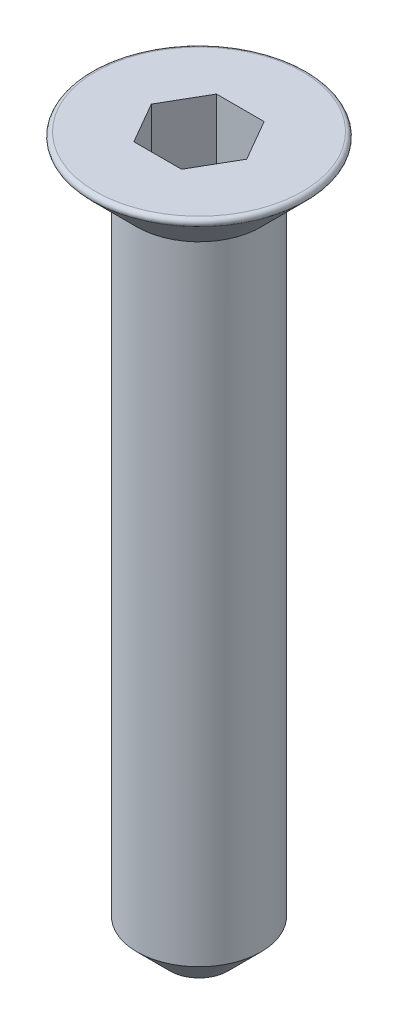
ISO-10303-21;
HEADER;
FILE_DESCRIPTION(('STEP AP214'),'2;1');
FILE_NAME('part.step','',(''),(''),'','','');
FILE_SCHEMA(('AUTOMOTIVE_DESIGN { 1 0 10303 214 1 1 1 1 }'));
ENDSEC;
DATA;
#1=APPLICATION_CONTEXT('core data for automotive mechanical design processes');
#2=APPLICATION_PROTOCOL_DEFINITION('international standard','automotive_design',2000,#1);
#3=PRODUCT_CONTEXT('',#1,'mechanical');
#4=PRODUCT('Part','Part','',(#3));
#5=PRODUCT_RELATED_PRODUCT_CATEGORY('part','',(#4));
#6=PRODUCT_DEFINITION_FORMATION('','',#4);
#7=PRODUCT_DEFINITION_CONTEXT('part definition',#1,'design');
#8=PRODUCT_DEFINITION('design','',#6,#7);
#9=PRODUCT_DEFINITION_SHAPE('','',#8);
#10=(LENGTH_UNIT() NAMED_UNIT(*) SI_UNIT(.MILLI.,.METRE.));
#11=(NAMED_UNIT(*) PLANE_ANGLE_UNIT() SI_UNIT($,.RADIAN.));
#12=(NAMED_UNIT(*) SI_UNIT($,.STERADIAN.) SOLID_ANGLE_UNIT());
#13=UNCERTAINTY_MEASURE_WITH_UNIT(LENGTH_MEASURE(1.E-05),#10,'distance_accuracy_value','');
#14=(GEOMETRIC_REPRESENTATION_CONTEXT(3) GLOBAL_UNCERTAINTY_ASSIGNED_CONTEXT((#13)) GLOBAL_UNIT_ASSIGNED_CONTEXT((#10,
#11,#12)) REPRESENTATION_CONTEXT('',''));
#15=CARTESIAN_POINT('',(0.,0.,0.));
#16=DIRECTION('',(0.,0.,1.));
#17=DIRECTION('',(1.,0.,0.));
#18=AXIS2_PLACEMENT_3D('',#15,#16,#17);
#19=CARTESIAN_POINT('',(0.,0.,0.));
#20=DIRECTION('',(0.,1.,0.));
#21=DIRECTION('',(0.,0.,1.));
#22=AXIS2_PLACEMENT_3D('',#19,#20,#21);
#23=PLANE('',#22);
#24=DIRECTION('',(0.5,0.,-0.866025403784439));
#25=VECTOR('',#24,1.);
#26=CARTESIAN_POINT('',(0.577350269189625,0.,1.));
#27=LINE('',#26,#25);
#28=CARTESIAN_POINT('',(0.577350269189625,0.,1.));
#29=VERTEX_POINT('',#28);
#30=CARTESIAN_POINT('',(1.15470053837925,0.,0.));
#31=VERTEX_POINT('',#30);
#32=EDGE_CURVE('E48',#29,#31,#27,.T.);
#33=ORIENTED_EDGE('',*,*,#32,.F.);
#34=DIRECTION('',(1.,0.,0.));
#35=VECTOR('',#34,1.);
#36=CARTESIAN_POINT('',(-0.577350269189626,0.,1.));
#37=LINE('',#36,#35);
#38=CARTESIAN_POINT('',(-0.577350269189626,0.,1.));
#39=VERTEX_POINT('',#38);
#40=EDGE_CURVE('E131',#39,#29,#37,.T.);
#41=ORIENTED_EDGE('',*,*,#40,.F.);
#42=DIRECTION('',(0.5,0.,0.866025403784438));
#43=VECTOR('',#42,1.);
#44=CARTESIAN_POINT('',(-1.15470053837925,0.,0.));
#45=LINE('',#44,#43);
#46=CARTESIAN_POINT('',(-1.15470053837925,0.,0.));
#47=VERTEX_POINT('',#46);
#48=EDGE_CURVE('E129',#47,#39,#45,.T.);
#49=ORIENTED_EDGE('',*,*,#48,.F.);
#50=DIRECTION('',(-0.5,0.,0.866025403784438));
#51=VECTOR('',#50,1.);
#52=CARTESIAN_POINT('',(-0.577350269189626,0.,-1.));
#53=LINE('',#52,#51);
#54=CARTESIAN_POINT('',(-0.577350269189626,0.,-1.));
#55=VERTEX_POINT('',#54);
#56=EDGE_CURVE('E96',#55,#47,#53,.T.);
#57=ORIENTED_EDGE('',*,*,#56,.F.);
#58=DIRECTION('',(-1.,0.,0.));
#59=VECTOR('',#58,1.);
#60=CARTESIAN_POINT('',(0.577350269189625,0.,-1.));
#61=LINE('',#60,#59);
#62=CARTESIAN_POINT('',(0.577350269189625,0.,-1.));
#63=VERTEX_POINT('',#62);
#64=EDGE_CURVE('E125',#63,#55,#61,.T.);
#65=ORIENTED_EDGE('',*,*,#64,.F.);
#66=DIRECTION('',(-0.5,0.,-0.866025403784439));
#67=VECTOR('',#66,1.);
#68=CARTESIAN_POINT('',(1.15470053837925,0.,0.));
#69=LINE('',#68,#67);
#70=EDGE_CURVE('E122',#31,#63,#69,.T.);
#71=ORIENTED_EDGE('',*,*,#70,.F.);
#72=EDGE_LOOP('',(#33,#41,#49,#57,#65,#71));
#73=FACE_BOUND('',#72,.T.);
#74=CARTESIAN_POINT('',(0.,0.,0.));
#75=DIRECTION('',(0.,1.,0.));
#76=DIRECTION('',(0.,0.,1.));
#77=AXIS2_PLACEMENT_3D('',#74,#75,#76);
#78=CIRCLE('',#77,2.50857864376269);
#79=CARTESIAN_POINT('',(0.,0.,2.50857864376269));
#80=VERTEX_POINT('',#79);
#81=EDGE_CURVE('E143',#80,#80,#78,.T.);
#82=ORIENTED_EDGE('',*,*,#81,.T.);
#83=EDGE_LOOP('',(#82));
#84=FACE_BOUND('',#83,.T.);
#85=ADVANCED_FACE('F33',(#73,#84),#23,.T.);
#86=CARTESIAN_POINT('',(0.,0.,0.));
#87=DIRECTION('',(0.,1.,0.));
#88=DIRECTION('',(0.,0.,1.));
#89=AXIS2_PLACEMENT_3D('',#86,#87,#88);
#90=CONICAL_SURFACE('',#89,2.75,0.78539816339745);
#91=CARTESIAN_POINT('',(0.,-0.170710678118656,0.));
#92=DIRECTION('',(0.,-1.,0.));
#93=DIRECTION('',(0.,0.,-1.));
#94=AXIS2_PLACEMENT_3D('',#91,#92,#93);
#95=CIRCLE('',#94,2.57928932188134);
#96=CARTESIAN_POINT('',(0.,-0.170710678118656,-2.57928932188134));
#97=VERTEX_POINT('',#96);
#98=EDGE_CURVE('E146',#97,#97,#95,.T.);
#99=ORIENTED_EDGE('',*,*,#98,.T.);
#100=EDGE_LOOP('',(#99));
#101=FACE_BOUND('',#100,.T.);
#102=CARTESIAN_POINT('',(0.,-1.25,0.));
#103=DIRECTION('',(0.,1.,0.));
#104=DIRECTION('',(0.,0.,1.));
#105=AXIS2_PLACEMENT_3D('',#102,#103,#104);
#106=CIRCLE('',#105,1.5);
#107=CARTESIAN_POINT('',(0.,-1.25,1.5));
#108=VERTEX_POINT('',#107);
#109=EDGE_CURVE('E135',#108,#108,#106,.T.);
#110=ORIENTED_EDGE('',*,*,#109,.T.);
#111=EDGE_LOOP('',(#110));
#112=FACE_BOUND('',#111,.T.);
#113=ADVANCED_FACE('F168',(#101,#112),#90,.T.);
#114=CARTESIAN_POINT('',(0.,15.4879719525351,0.));
#115=DIRECTION('',(0.,1.,0.));
#116=DIRECTION('',(0.,0.,1.));
#117=AXIS2_PLACEMENT_3D('',#114,#115,#116);
#118=CYLINDRICAL_SURFACE('',#117,1.5);
#119=CARTESIAN_POINT('',(0.,-16.45,0.));
#120=DIRECTION('',(0.,-1.,0.));
#121=DIRECTION('',(0.,0.,-1.));
#122=AXIS2_PLACEMENT_3D('',#119,#120,#121);
#123=CIRCLE('',#122,1.5);
#124=CARTESIAN_POINT('',(0.,-16.45,-1.5));
#125=VERTEX_POINT('',#124);
#126=EDGE_CURVE('E41',#125,#125,#123,.F.);
#127=ORIENTED_EDGE('',*,*,#126,.T.);
#128=EDGE_LOOP('',(#127));
#129=FACE_BOUND('',#128,.T.);
#130=ORIENTED_EDGE('',*,*,#109,.F.);
#131=EDGE_LOOP('',(#130));
#132=FACE_BOUND('',#131,.T.);
#133=ADVANCED_FACE('F151',(#129,#132),#118,.T.);
#134=CARTESIAN_POINT('',(1.5,-17.25,0.));
#135=DIRECTION('',(0.,-1.,0.));
#136=DIRECTION('',(0.,0.,-1.));
#137=AXIS2_PLACEMENT_3D('',#134,#135,#136);
#138=PLANE('',#137);
#139=CARTESIAN_POINT('',(0.,-17.25,0.));
#140=DIRECTION('',(0.,-1.,0.));
#141=DIRECTION('',(0.,0.,-1.));
#142=AXIS2_PLACEMENT_3D('',#139,#140,#141);
#143=CIRCLE('',#142,0.699999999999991);
#144=CARTESIAN_POINT('',(0.,-17.25,-0.699999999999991));
#145=VERTEX_POINT('',#144);
#146=EDGE_CURVE('E11',#145,#145,#143,.T.);
#147=ORIENTED_EDGE('',*,*,#146,.T.);
#148=EDGE_LOOP('',(#147));
#149=FACE_BOUND('',#148,.T.);
#150=ADVANCED_FACE('F164',(#149),#138,.T.);
#151=CARTESIAN_POINT('',(0.,-0.1,0.));
#152=DIRECTION('',(0.,1.,0.));
#153=DIRECTION('',(0.,0.,1.));
#154=AXIS2_PLACEMENT_3D('',#151,#152,#153);
#155=TOROIDAL_SURFACE('',#154,2.50857864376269,0.1);
#156=ORIENTED_EDGE('',*,*,#98,.F.);
#157=EDGE_LOOP('',(#156));
#158=FACE_BOUND('',#157,.T.);
#159=ORIENTED_EDGE('',*,*,#81,.F.);
#160=EDGE_LOOP('',(#159));
#161=FACE_BOUND('',#160,.T.);
#162=ADVANCED_FACE('F156',(#158,#161),#155,.T.);
#163=CARTESIAN_POINT('',(0.,-16.45,0.));
#164=DIRECTION('',(0.,1.,0.));
#165=DIRECTION('',(0.,0.,1.));
#166=AXIS2_PLACEMENT_3D('',#163,#164,#165);
#167=CONICAL_SURFACE('',#166,1.5,0.785398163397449);
#168=ORIENTED_EDGE('',*,*,#146,.F.);
#169=EDGE_LOOP('',(#168));
#170=FACE_BOUND('',#169,.T.);
#171=ORIENTED_EDGE('',*,*,#126,.F.);
#172=EDGE_LOOP('',(#171));
#173=FACE_BOUND('',#172,.T.);
#174=ADVANCED_FACE('F35',(#170,#173),#167,.T.);
#175=CARTESIAN_POINT('',(0.577350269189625,-3.,1.));
#176=DIRECTION('',(0.866025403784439,0.,0.5));
#177=DIRECTION('',(0.5,0.,-0.866025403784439));
#178=AXIS2_PLACEMENT_3D('',#175,#176,#177);
#179=PLANE('',#178);
#180=ORIENTED_EDGE('',*,*,#32,.T.);
#181=DIRECTION('',(0.,1.,0.));
#182=VECTOR('',#181,1.);
#183=CARTESIAN_POINT('',(1.15470053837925,-3.,0.));
#184=LINE('',#183,#182);
#185=CARTESIAN_POINT('',(1.15470053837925,-3.,0.));
#186=VERTEX_POINT('',#185);
#187=EDGE_CURVE('E78',#186,#31,#184,.T.);
#188=ORIENTED_EDGE('',*,*,#187,.F.);
#189=DIRECTION('',(0.5,0.,-0.866025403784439));
#190=VECTOR('',#189,1.);
#191=CARTESIAN_POINT('',(0.577350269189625,-3.,1.));
#192=LINE('',#191,#190);
#193=CARTESIAN_POINT('',(0.577350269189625,-3.,1.));
#194=VERTEX_POINT('',#193);
#195=EDGE_CURVE('E133',#194,#186,#192,.T.);
#196=ORIENTED_EDGE('',*,*,#195,.F.);
#197=DIRECTION('',(0.,1.,0.));
#198=VECTOR('',#197,1.);
#199=CARTESIAN_POINT('',(0.577350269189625,-3.,1.));
#200=LINE('',#199,#198);
#201=EDGE_CURVE('E56',#194,#29,#200,.T.);
#202=ORIENTED_EDGE('',*,*,#201,.T.);
#203=EDGE_LOOP('',(#180,#188,#196,#202));
#204=FACE_BOUND('',#203,.T.);
#205=ADVANCED_FACE('F155',(#204),#179,.F.);
#206=CARTESIAN_POINT('',(-0.577350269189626,-3.,1.));
#207=DIRECTION('',(0.,0.,1.));
#208=DIRECTION('',(1.,0.,0.));
#209=AXIS2_PLACEMENT_3D('',#206,#207,#208);
#210=PLANE('',#209);
#211=ORIENTED_EDGE('',*,*,#40,.T.);
#212=ORIENTED_EDGE('',*,*,#201,.F.);
#213=DIRECTION('',(1.,0.,0.));
#214=VECTOR('',#213,1.);
#215=CARTESIAN_POINT('',(-0.577350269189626,-3.,1.));
#216=LINE('',#215,#214);
#217=CARTESIAN_POINT('',(-0.577350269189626,-3.,1.));
#218=VERTEX_POINT('',#217);
#219=EDGE_CURVE('E108',#218,#194,#216,.T.);
#220=ORIENTED_EDGE('',*,*,#219,.F.);
#221=DIRECTION('',(0.,1.,0.));
#222=VECTOR('',#221,1.);
#223=CARTESIAN_POINT('',(-0.577350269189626,-3.,1.));
#224=LINE('',#223,#222);
#225=EDGE_CURVE('E100',#218,#39,#224,.T.);
#226=ORIENTED_EDGE('',*,*,#225,.T.);
#227=EDGE_LOOP('',(#211,#212,#220,#226));
#228=FACE_BOUND('',#227,.T.);
#229=ADVANCED_FACE('F162',(#228),#210,.F.);
#230=CARTESIAN_POINT('',(-1.15470053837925,-3.,0.));
#231=DIRECTION('',(-0.866025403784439,0.,0.5));
#232=DIRECTION('',(0.5,0.,0.866025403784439));
#233=AXIS2_PLACEMENT_3D('',#230,#231,#232);
#234=PLANE('',#233);
#235=ORIENTED_EDGE('',*,*,#48,.T.);
#236=ORIENTED_EDGE('',*,*,#225,.F.);
#237=DIRECTION('',(0.5,0.,0.866025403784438));
#238=VECTOR('',#237,1.);
#239=CARTESIAN_POINT('',(-1.15470053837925,-3.,0.));
#240=LINE('',#239,#238);
#241=CARTESIAN_POINT('',(-1.15470053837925,-3.,0.));
#242=VERTEX_POINT('',#241);
#243=EDGE_CURVE('E104',#242,#218,#240,.T.);
#244=ORIENTED_EDGE('',*,*,#243,.F.);
#245=DIRECTION('',(0.,1.,0.));
#246=VECTOR('',#245,1.);
#247=CARTESIAN_POINT('',(-1.15470053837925,-3.,0.));
#248=LINE('',#247,#246);
#249=EDGE_CURVE('E89',#242,#47,#248,.T.);
#250=ORIENTED_EDGE('',*,*,#249,.T.);
#251=EDGE_LOOP('',(#235,#236,#244,#250));
#252=FACE_BOUND('',#251,.T.);
#253=ADVANCED_FACE('F105',(#252),#234,.F.);
#254=CARTESIAN_POINT('',(-0.577350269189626,-3.,-1.));
#255=DIRECTION('',(-0.866025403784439,0.,-0.5));
#256=DIRECTION('',(-0.5,0.,0.866025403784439));
#257=AXIS2_PLACEMENT_3D('',#254,#255,#256);
#258=PLANE('',#257);
#259=ORIENTED_EDGE('',*,*,#56,.T.);
#260=ORIENTED_EDGE('',*,*,#249,.F.);
#261=DIRECTION('',(-0.5,0.,0.866025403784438));
#262=VECTOR('',#261,1.);
#263=CARTESIAN_POINT('',(-0.577350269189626,-3.,-1.));
#264=LINE('',#263,#262);
#265=CARTESIAN_POINT('',(-0.577350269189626,-3.,-1.));
#266=VERTEX_POINT('',#265);
#267=EDGE_CURVE('E93',#266,#242,#264,.T.);
#268=ORIENTED_EDGE('',*,*,#267,.F.);
#269=DIRECTION('',(0.,1.,0.));
#270=VECTOR('',#269,1.);
#271=CARTESIAN_POINT('',(-0.577350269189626,-3.,-1.));
#272=LINE('',#271,#270);
#273=EDGE_CURVE('E101',#266,#55,#272,.T.);
#274=ORIENTED_EDGE('',*,*,#273,.T.);
#275=EDGE_LOOP('',(#259,#260,#268,#274));
#276=FACE_BOUND('',#275,.T.);
#277=ADVANCED_FACE('F91',(#276),#258,.F.);
#278=CARTESIAN_POINT('',(0.577350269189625,-3.,-1.));
#279=DIRECTION('',(0.,0.,-1.));
#280=DIRECTION('',(-1.,0.,0.));
#281=AXIS2_PLACEMENT_3D('',#278,#279,#280);
#282=PLANE('',#281);
#283=ORIENTED_EDGE('',*,*,#64,.T.);
#284=ORIENTED_EDGE('',*,*,#273,.F.);
#285=DIRECTION('',(-1.,0.,0.));
#286=VECTOR('',#285,1.);
#287=CARTESIAN_POINT('',(0.577350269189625,-3.,-1.));
#288=LINE('',#287,#286);
#289=CARTESIAN_POINT('',(0.577350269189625,-3.,-1.));
#290=VERTEX_POINT('',#289);
#291=EDGE_CURVE('E114',#290,#266,#288,.T.);
#292=ORIENTED_EDGE('',*,*,#291,.F.);
#293=DIRECTION('',(0.,1.,0.));
#294=VECTOR('',#293,1.);
#295=CARTESIAN_POINT('',(0.577350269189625,-3.,-1.));
#296=LINE('',#295,#294);
#297=EDGE_CURVE('E138',#290,#63,#296,.T.);
#298=ORIENTED_EDGE('',*,*,#297,.T.);
#299=EDGE_LOOP('',(#283,#284,#292,#298));
#300=FACE_BOUND('',#299,.T.);
#301=ADVANCED_FACE('F186',(#300),#282,.F.);
#302=CARTESIAN_POINT('',(1.15470053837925,-3.,0.));
#303=DIRECTION('',(0.866025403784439,0.,-0.5));
#304=DIRECTION('',(-0.5,0.,-0.866025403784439));
#305=AXIS2_PLACEMENT_3D('',#302,#303,#304);
#306=PLANE('',#305);
#307=ORIENTED_EDGE('',*,*,#70,.T.);
#308=ORIENTED_EDGE('',*,*,#297,.F.);
#309=DIRECTION('',(-0.5,0.,-0.866025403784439));
#310=VECTOR('',#309,1.);
#311=CARTESIAN_POINT('',(1.15470053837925,-3.,0.));
#312=LINE('',#311,#310);
#313=EDGE_CURVE('E116',#186,#290,#312,.T.);
#314=ORIENTED_EDGE('',*,*,#313,.F.);
#315=ORIENTED_EDGE('',*,*,#187,.T.);
#316=EDGE_LOOP('',(#307,#308,#314,#315));
#317=FACE_BOUND('',#316,.T.);
#318=ADVANCED_FACE('F183',(#317),#306,.F.);
#319=CARTESIAN_POINT('',(1.15470053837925,-3.,0.));
#320=DIRECTION('',(0.,1.,0.));
#321=DIRECTION('',(0.,0.,1.));
#322=AXIS2_PLACEMENT_3D('',#319,#320,#321);
#323=PLANE('',#322);
#324=ORIENTED_EDGE('',*,*,#195,.T.);
#325=ORIENTED_EDGE('',*,*,#313,.T.);
#326=ORIENTED_EDGE('',*,*,#291,.T.);
#327=ORIENTED_EDGE('',*,*,#267,.T.);
#328=ORIENTED_EDGE('',*,*,#243,.T.);
#329=ORIENTED_EDGE('',*,*,#219,.T.);
#330=EDGE_LOOP('',(#324,#325,#326,#327,#328,#329));
#331=FACE_BOUND('',#330,.T.);
#332=ADVANCED_FACE('F111',(#331),#323,.T.);
#333=CLOSED_SHELL('',(#85,#113,#133,#150,#162,#174,#205,#229,#253,#277,#301,#318,#332));
#334=MANIFOLD_SOLID_BREP('B2',#333);
#335=ADVANCED_BREP_SHAPE_REPRESENTATION('',(#18,#334),#14);
#336=SHAPE_DEFINITION_REPRESENTATION(#9,#335);
ENDSEC;
END-ISO-10303-21;
